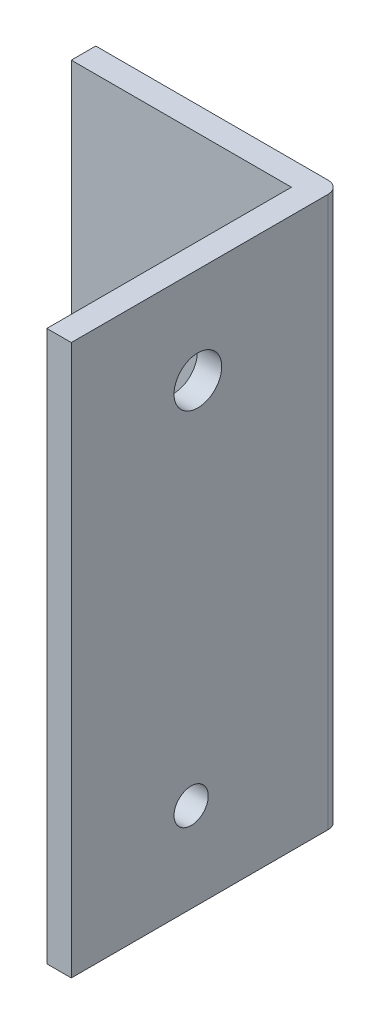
from build123d import *

# Parameters (mm, degrees)
SKETCH1_W           = 50.8
SKETCH1_H           = 114.3
BOSS_EXTRUDE1_DEPTH = 5.08
SKETCH2_W           = 50.8
SKETCH2_H           = 114.3
BOSS_EXTRUDE2_DEPTH = 5.08
FILLET1_R           = 2.54
SKETCH3_R           = 4.953
SKETCH3_R_2         = 3.556
CUT_EXTRUDE1_DEPTH  = 93.081568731


with BuildPart() as part:
    # Sketch1 → Boss-Extrude1 (new body)
    with BuildSketch(Plane.XY):
        Rectangle(SKETCH1_W, SKETCH1_H)
    extrude(amount=BOSS_EXTRUDE1_DEPTH)

    # Sketch2 → Boss-Extrude2 (add)
    with BuildSketch(Plane(origin=(25.4, 0, 0), x_dir=(0, 0, -1), z_dir=(1, 0, 0))):
        with Locations((-30.48, 0)):
            Rectangle(SKETCH2_W, SKETCH2_H)
    extrude(amount=-BOSS_EXTRUDE2_DEPTH)

    # Fillet1
    fillet1_edges = [part.edges().sort_by_distance(p)[0] for p in [
        (25.4, 0, 0),
    ]]
    fillet(fillet1_edges, radius=FILLET1_R)

    # Sketch3 → Cut-Extrude1 (cut, through all)
    with BuildSketch(Plane.ZY.offset(-20.32)):
        with Locations((29.591, 37.211)):
            Circle(SKETCH3_R)
        with Locations((30.988, -38.608)):
            Circle(SKETCH3_R_2)
    extrude(amount=-CUT_EXTRUDE1_DEPTH, mode=Mode.SUBTRACT)


solid = part.part
